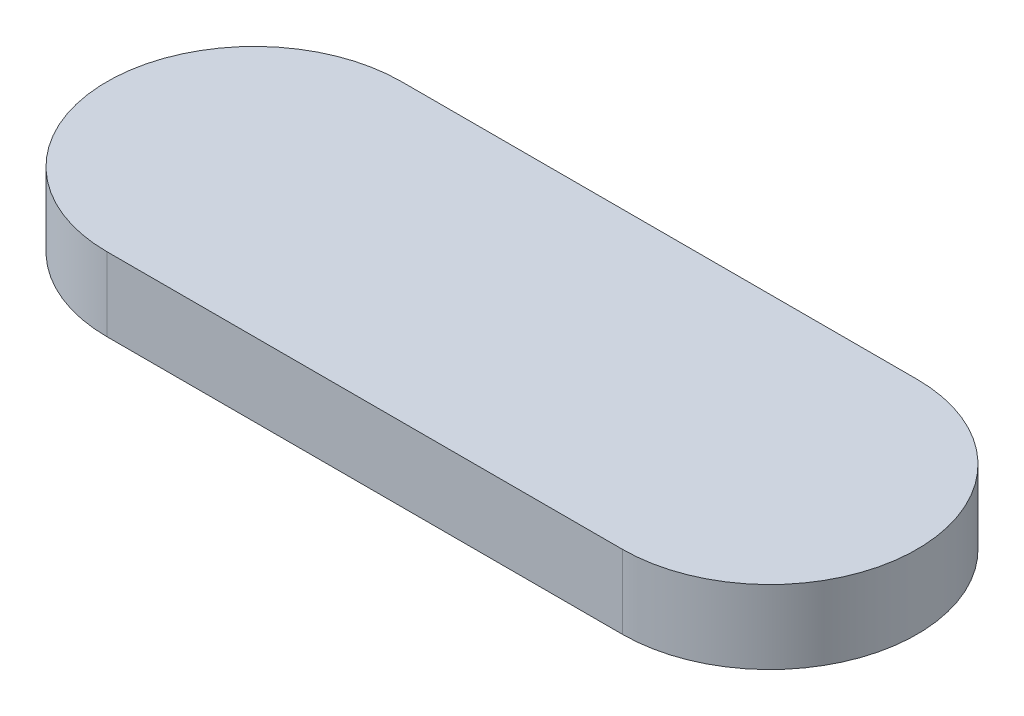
ISO-10303-21;
HEADER;
FILE_DESCRIPTION(('STEP AP214'),'2;1');
FILE_NAME('part.step','',(''),(''),'','','');
FILE_SCHEMA(('AUTOMOTIVE_DESIGN { 1 0 10303 214 1 1 1 1 }'));
ENDSEC;
DATA;
#1=APPLICATION_CONTEXT('core data for automotive mechanical design processes');
#2=APPLICATION_PROTOCOL_DEFINITION('international standard','automotive_design',2000,#1);
#3=PRODUCT_CONTEXT('',#1,'mechanical');
#4=PRODUCT('Part','Part','',(#3));
#5=PRODUCT_RELATED_PRODUCT_CATEGORY('part','',(#4));
#6=PRODUCT_DEFINITION_FORMATION('','',#4);
#7=PRODUCT_DEFINITION_CONTEXT('part definition',#1,'design');
#8=PRODUCT_DEFINITION('design','',#6,#7);
#9=PRODUCT_DEFINITION_SHAPE('','',#8);
#10=(LENGTH_UNIT() NAMED_UNIT(*) SI_UNIT(.MILLI.,.METRE.));
#11=(NAMED_UNIT(*) PLANE_ANGLE_UNIT() SI_UNIT($,.RADIAN.));
#12=(NAMED_UNIT(*) SI_UNIT($,.STERADIAN.) SOLID_ANGLE_UNIT());
#13=UNCERTAINTY_MEASURE_WITH_UNIT(LENGTH_MEASURE(1.E-05),#10,'distance_accuracy_value','');
#14=(GEOMETRIC_REPRESENTATION_CONTEXT(3) GLOBAL_UNCERTAINTY_ASSIGNED_CONTEXT((#13)) GLOBAL_UNIT_ASSIGNED_CONTEXT((#10,
#11,#12)) REPRESENTATION_CONTEXT('',''));
#15=CARTESIAN_POINT('',(0.,0.,0.));
#16=DIRECTION('',(0.,0.,1.));
#17=DIRECTION('',(1.,0.,0.));
#18=AXIS2_PLACEMENT_3D('',#15,#16,#17);
#19=CARTESIAN_POINT('',(0.,5.,0.));
#20=DIRECTION('',(0.,-1.,0.));
#21=DIRECTION('',(0.,0.,-1.));
#22=AXIS2_PLACEMENT_3D('',#19,#20,#21);
#23=CYLINDRICAL_SURFACE('',#22,10.);
#24=CARTESIAN_POINT('',(0.,0.,0.));
#25=DIRECTION('',(0.,1.,0.));
#26=DIRECTION('',(0.,0.,-1.));
#27=AXIS2_PLACEMENT_3D('',#24,#25,#26);
#28=CIRCLE('',#27,10.);
#29=CARTESIAN_POINT('',(0.,0.,-10.));
#30=VERTEX_POINT('',#29);
#31=CARTESIAN_POINT('',(0.,0.,10.));
#32=VERTEX_POINT('',#31);
#33=EDGE_CURVE('E94',#30,#32,#28,.T.);
#34=ORIENTED_EDGE('',*,*,#33,.T.);
#35=DIRECTION('',(0.,-1.,0.));
#36=VECTOR('',#35,1.);
#37=CARTESIAN_POINT('',(0.,5.,10.));
#38=LINE('',#37,#36);
#39=CARTESIAN_POINT('',(0.,5.,10.));
#40=VERTEX_POINT('',#39);
#41=EDGE_CURVE('E11',#40,#32,#38,.T.);
#42=ORIENTED_EDGE('',*,*,#41,.F.);
#43=CARTESIAN_POINT('',(0.,5.,0.));
#44=DIRECTION('',(0.,1.,0.));
#45=DIRECTION('',(0.,0.,-1.));
#46=AXIS2_PLACEMENT_3D('',#43,#44,#45);
#47=CIRCLE('',#46,10.);
#48=CARTESIAN_POINT('',(0.,5.,-10.));
#49=VERTEX_POINT('',#48);
#50=EDGE_CURVE('E82',#49,#40,#47,.T.);
#51=ORIENTED_EDGE('',*,*,#50,.F.);
#52=DIRECTION('',(0.,-1.,0.));
#53=VECTOR('',#52,1.);
#54=CARTESIAN_POINT('',(0.,5.,-10.));
#55=LINE('',#54,#53);
#56=EDGE_CURVE('E90',#49,#30,#55,.T.);
#57=ORIENTED_EDGE('',*,*,#56,.T.);
#58=EDGE_LOOP('',(#34,#42,#51,#57));
#59=FACE_BOUND('',#58,.T.);
#60=ADVANCED_FACE('F31',(#59),#23,.T.);
#61=CARTESIAN_POINT('',(0.,5.,10.));
#62=DIRECTION('',(0.,0.,-1.));
#63=DIRECTION('',(-1.,0.,0.));
#64=AXIS2_PLACEMENT_3D('',#61,#62,#63);
#65=PLANE('',#64);
#66=DIRECTION('',(1.,0.,0.));
#67=VECTOR('',#66,1.);
#68=CARTESIAN_POINT('',(0.,0.,10.));
#69=LINE('',#68,#67);
#70=CARTESIAN_POINT('',(35.,0.,10.));
#71=VERTEX_POINT('',#70);
#72=EDGE_CURVE('E86',#32,#71,#69,.T.);
#73=ORIENTED_EDGE('',*,*,#72,.T.);
#74=DIRECTION('',(0.,-1.,0.));
#75=VECTOR('',#74,1.);
#76=CARTESIAN_POINT('',(35.,5.,10.));
#77=LINE('',#76,#75);
#78=CARTESIAN_POINT('',(35.,5.,10.));
#79=VERTEX_POINT('',#78);
#80=EDGE_CURVE('E39',#79,#71,#77,.T.);
#81=ORIENTED_EDGE('',*,*,#80,.F.);
#82=DIRECTION('',(1.,0.,0.));
#83=VECTOR('',#82,1.);
#84=CARTESIAN_POINT('',(0.,5.,10.));
#85=LINE('',#84,#83);
#86=EDGE_CURVE('E77',#40,#79,#85,.T.);
#87=ORIENTED_EDGE('',*,*,#86,.F.);
#88=ORIENTED_EDGE('',*,*,#41,.T.);
#89=EDGE_LOOP('',(#73,#81,#87,#88));
#90=FACE_BOUND('',#89,.T.);
#91=ADVANCED_FACE('F85',(#90),#65,.F.);
#92=CARTESIAN_POINT('',(35.,5.,0.));
#93=DIRECTION('',(0.,-1.,0.));
#94=DIRECTION('',(0.,0.,-1.));
#95=AXIS2_PLACEMENT_3D('',#92,#93,#94);
#96=CYLINDRICAL_SURFACE('',#95,10.);
#97=CARTESIAN_POINT('',(35.,0.,0.));
#98=DIRECTION('',(0.,1.,0.));
#99=DIRECTION('',(0.,0.,1.));
#100=AXIS2_PLACEMENT_3D('',#97,#98,#99);
#101=CIRCLE('',#100,10.);
#102=CARTESIAN_POINT('',(35.,0.,-10.));
#103=VERTEX_POINT('',#102);
#104=EDGE_CURVE('E64',#71,#103,#101,.T.);
#105=ORIENTED_EDGE('',*,*,#104,.T.);
#106=DIRECTION('',(0.,-1.,0.));
#107=VECTOR('',#106,1.);
#108=CARTESIAN_POINT('',(35.,5.,-10.));
#109=LINE('',#108,#107);
#110=CARTESIAN_POINT('',(35.,5.,-10.));
#111=VERTEX_POINT('',#110);
#112=EDGE_CURVE('E87',#111,#103,#109,.T.);
#113=ORIENTED_EDGE('',*,*,#112,.F.);
#114=CARTESIAN_POINT('',(35.,5.,0.));
#115=DIRECTION('',(0.,1.,0.));
#116=DIRECTION('',(0.,0.,1.));
#117=AXIS2_PLACEMENT_3D('',#114,#115,#116);
#118=CIRCLE('',#117,10.);
#119=EDGE_CURVE('E80',#79,#111,#118,.T.);
#120=ORIENTED_EDGE('',*,*,#119,.F.);
#121=ORIENTED_EDGE('',*,*,#80,.T.);
#122=EDGE_LOOP('',(#105,#113,#120,#121));
#123=FACE_BOUND('',#122,.T.);
#124=ADVANCED_FACE('F88',(#123),#96,.T.);
#125=CARTESIAN_POINT('',(0.,5.,-10.));
#126=DIRECTION('',(0.,0.,1.));
#127=DIRECTION('',(1.,0.,0.));
#128=AXIS2_PLACEMENT_3D('',#125,#126,#127);
#129=PLANE('',#128);
#130=DIRECTION('',(-1.,0.,0.));
#131=VECTOR('',#130,1.);
#132=CARTESIAN_POINT('',(0.,0.,-10.));
#133=LINE('',#132,#131);
#134=EDGE_CURVE('E70',#103,#30,#133,.T.);
#135=ORIENTED_EDGE('',*,*,#134,.T.);
#136=ORIENTED_EDGE('',*,*,#56,.F.);
#137=DIRECTION('',(-1.,0.,0.));
#138=VECTOR('',#137,1.);
#139=CARTESIAN_POINT('',(0.,5.,-10.));
#140=LINE('',#139,#138);
#141=EDGE_CURVE('E47',#111,#49,#140,.T.);
#142=ORIENTED_EDGE('',*,*,#141,.F.);
#143=ORIENTED_EDGE('',*,*,#112,.T.);
#144=EDGE_LOOP('',(#135,#136,#142,#143));
#145=FACE_BOUND('',#144,.T.);
#146=ADVANCED_FACE('F101',(#145),#129,.F.);
#147=CARTESIAN_POINT('',(0.,5.,0.));
#148=DIRECTION('',(0.,-1.,0.));
#149=DIRECTION('',(0.,0.,-1.));
#150=AXIS2_PLACEMENT_3D('',#147,#148,#149);
#151=PLANE('',#150);
#152=ORIENTED_EDGE('',*,*,#50,.T.);
#153=ORIENTED_EDGE('',*,*,#86,.T.);
#154=ORIENTED_EDGE('',*,*,#119,.T.);
#155=ORIENTED_EDGE('',*,*,#141,.T.);
#156=EDGE_LOOP('',(#152,#153,#154,#155));
#157=FACE_BOUND('',#156,.T.);
#158=ADVANCED_FACE('F78',(#157),#151,.F.);
#159=CARTESIAN_POINT('',(0.,0.,0.));
#160=DIRECTION('',(0.,-1.,0.));
#161=DIRECTION('',(0.,0.,-1.));
#162=AXIS2_PLACEMENT_3D('',#159,#160,#161);
#163=PLANE('',#162);
#164=ORIENTED_EDGE('',*,*,#33,.F.);
#165=ORIENTED_EDGE('',*,*,#134,.F.);
#166=ORIENTED_EDGE('',*,*,#104,.F.);
#167=ORIENTED_EDGE('',*,*,#72,.F.);
#168=EDGE_LOOP('',(#164,#165,#166,#167));
#169=FACE_BOUND('',#168,.T.);
#170=ADVANCED_FACE('F104',(#169),#163,.T.);
#171=CLOSED_SHELL('',(#60,#91,#124,#146,#158,#170));
#172=MANIFOLD_SOLID_BREP('B2',#171);
#173=ADVANCED_BREP_SHAPE_REPRESENTATION('',(#18,#172),#14);
#174=SHAPE_DEFINITION_REPRESENTATION(#9,#173);
ENDSEC;
END-ISO-10303-21;
